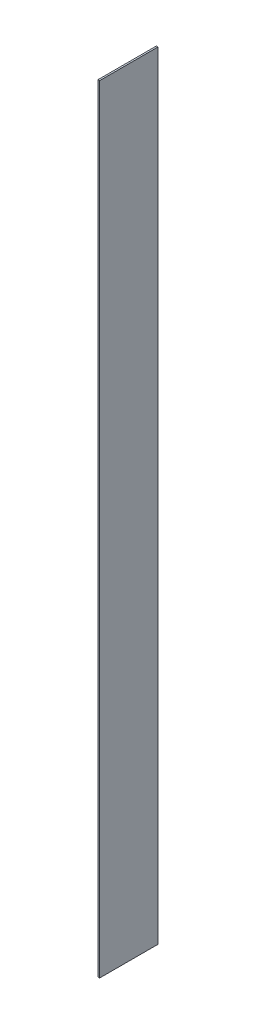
from build123d import *

# Parameters (mm, degrees)
SKETCH1_W           = 38.1
SKETCH1_H           = 1346.0125
BOSS_EXTRUDE1_DEPTH = 8973.4125


with BuildPart() as part:
    # Sketch1 → Boss-Extrude1 (new, symmetric)
    with BuildSketch(Plane(origin=(0, 0, 0), x_dir=(-1, 0, 0), z_dir=(0, 1, 0))):
        Rectangle(SKETCH1_W, SKETCH1_H)
    extrude(amount=BOSS_EXTRUDE1_DEPTH, both=True)


solid = part.part
